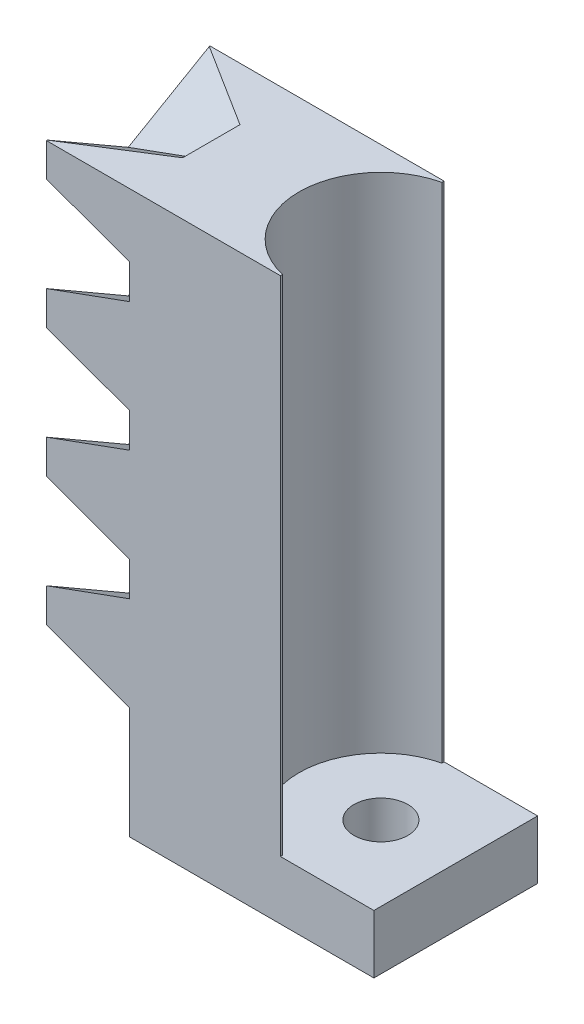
ISO-10303-21;
HEADER;
FILE_DESCRIPTION(('STEP AP214'),'2;1');
FILE_NAME('part.step','',(''),(''),'','','');
FILE_SCHEMA(('AUTOMOTIVE_DESIGN { 1 0 10303 214 1 1 1 1 }'));
ENDSEC;
DATA;
#1=APPLICATION_CONTEXT('core data for automotive mechanical design processes');
#2=APPLICATION_PROTOCOL_DEFINITION('international standard','automotive_design',2000,#1);
#3=PRODUCT_CONTEXT('',#1,'mechanical');
#4=PRODUCT('Part','Part','',(#3));
#5=PRODUCT_RELATED_PRODUCT_CATEGORY('part','',(#4));
#6=PRODUCT_DEFINITION_FORMATION('','',#4);
#7=PRODUCT_DEFINITION_CONTEXT('part definition',#1,'design');
#8=PRODUCT_DEFINITION('design','',#6,#7);
#9=PRODUCT_DEFINITION_SHAPE('','',#8);
#10=(LENGTH_UNIT() NAMED_UNIT(*) SI_UNIT(.MILLI.,.METRE.));
#11=(NAMED_UNIT(*) PLANE_ANGLE_UNIT() SI_UNIT($,.RADIAN.));
#12=(NAMED_UNIT(*) SI_UNIT($,.STERADIAN.) SOLID_ANGLE_UNIT());
#13=UNCERTAINTY_MEASURE_WITH_UNIT(LENGTH_MEASURE(1.E-05),#10,'distance_accuracy_value','');
#14=(GEOMETRIC_REPRESENTATION_CONTEXT(3) GLOBAL_UNCERTAINTY_ASSIGNED_CONTEXT((#13)) GLOBAL_UNIT_ASSIGNED_CONTEXT((#10,
#11,#12)) REPRESENTATION_CONTEXT('',''));
#15=CARTESIAN_POINT('',(0.,0.,0.));
#16=DIRECTION('',(0.,0.,1.));
#17=DIRECTION('',(1.,0.,0.));
#18=AXIS2_PLACEMENT_3D('',#15,#16,#17);
#19=CARTESIAN_POINT('',(8.2,16.4726196,3.5));
#20=DIRECTION('',(-1.,0.,0.));
#21=DIRECTION('',(0.,-1.,0.));
#22=AXIS2_PLACEMENT_3D('',#19,#20,#21);
#23=PLANE('',#22);
#24=DIRECTION('',(0.,-1.,0.));
#25=VECTOR('',#24,1.);
#26=CARTESIAN_POINT('',(8.2,16.4726446,-3.40734500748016));
#27=LINE('',#26,#25);
#28=CARTESIAN_POINT('',(8.2,-5.0273804,-3.40734500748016));
#29=VERTEX_POINT('',#28);
#30=CARTESIAN_POINT('',(8.2,16.4726196,-3.40734500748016));
#31=VERTEX_POINT('',#30);
#32=EDGE_CURVE('E355',#29,#31,#27,.F.);
#33=ORIENTED_EDGE('',*,*,#32,.F.);
#34=DIRECTION('',(0.,0.,1.));
#35=VECTOR('',#34,1.);
#36=CARTESIAN_POINT('',(8.2,-5.0273804,-3.5));
#37=LINE('',#36,#35);
#38=CARTESIAN_POINT('',(8.2,-5.0273804,-3.5));
#39=VERTEX_POINT('',#38);
#40=EDGE_CURVE('E363',#39,#29,#37,.T.);
#41=ORIENTED_EDGE('',*,*,#40,.F.);
#42=DIRECTION('',(0.,1.,0.));
#43=VECTOR('',#42,1.);
#44=CARTESIAN_POINT('',(8.2,16.4726196,-3.5));
#45=LINE('',#44,#43);
#46=CARTESIAN_POINT('',(8.2,16.4726196,-3.5));
#47=VERTEX_POINT('',#46);
#48=EDGE_CURVE('E966',#39,#47,#45,.T.);
#49=ORIENTED_EDGE('',*,*,#48,.T.);
#50=DIRECTION('',(0.,0.,-1.));
#51=VECTOR('',#50,1.);
#52=CARTESIAN_POINT('',(8.2,16.4726196,3.5));
#53=LINE('',#52,#51);
#54=EDGE_CURVE('E981',#31,#47,#53,.T.);
#55=ORIENTED_EDGE('',*,*,#54,.F.);
#56=EDGE_LOOP('',(#33,#41,#49,#55));
#57=FACE_BOUND('',#56,.T.);
#58=ADVANCED_FACE('F125',(#57),#23,.F.);
#59=DIRECTION('',(0.,-1.,0.));
#60=VECTOR('',#59,1.);
#61=CARTESIAN_POINT('',(8.2,16.4726446,3.40734500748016));
#62=LINE('',#61,#60);
#63=CARTESIAN_POINT('',(8.2,16.4726196,3.40734500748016));
#64=VERTEX_POINT('',#63);
#65=CARTESIAN_POINT('',(8.2,-5.0273804,3.40734500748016));
#66=VERTEX_POINT('',#65);
#67=EDGE_CURVE('E343',#64,#66,#62,.T.);
#68=ORIENTED_EDGE('',*,*,#67,.F.);
#69=CARTESIAN_POINT('',(8.2,16.4726196,3.5));
#70=VERTEX_POINT('',#69);
#71=EDGE_CURVE('E1114',#70,#64,#53,.T.);
#72=ORIENTED_EDGE('',*,*,#71,.F.);
#73=DIRECTION('',(0.,1.,0.));
#74=VECTOR('',#73,1.);
#75=CARTESIAN_POINT('',(8.2,16.4726196,3.5));
#76=LINE('',#75,#74);
#77=CARTESIAN_POINT('',(8.2,-5.0273804,3.5));
#78=VERTEX_POINT('',#77);
#79=EDGE_CURVE('E367',#78,#70,#76,.T.);
#80=ORIENTED_EDGE('',*,*,#79,.F.);
#81=EDGE_CURVE('E361',#66,#78,#37,.T.);
#82=ORIENTED_EDGE('',*,*,#81,.F.);
#83=EDGE_LOOP('',(#68,#72,#80,#82));
#84=FACE_BOUND('',#83,.T.);
#85=ADVANCED_FACE('F366',(#84),#23,.F.);
#86=CARTESIAN_POINT('',(-1.8,-7.5273804,3.5));
#87=DIRECTION('',(1.,0.,0.));
#88=DIRECTION('',(0.,1.,0.));
#89=AXIS2_PLACEMENT_3D('',#86,#87,#88);
#90=PLANE('',#89);
#91=DIRECTION('',(0.,0.500000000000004,0.866025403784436));
#92=VECTOR('',#91,1.);
#93=CARTESIAN_POINT('',(-1.8,14.4726196,0.));
#94=LINE('',#93,#92);
#95=CARTESIAN_POINT('',(-1.8,14.4726196,0.));
#96=VERTEX_POINT('',#95);
#97=CARTESIAN_POINT('',(-1.8,16.4726196,3.46410161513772));
#98=VERTEX_POINT('',#97);
#99=EDGE_CURVE('E399',#96,#98,#94,.T.);
#100=ORIENTED_EDGE('',*,*,#99,.F.);
#101=DIRECTION('',(0.,0.500000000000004,-0.866025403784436));
#102=VECTOR('',#101,1.);
#103=CARTESIAN_POINT('',(-1.8,14.4726196,0.));
#104=LINE('',#103,#102);
#105=CARTESIAN_POINT('',(-1.8,16.4726196,-3.46410161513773));
#106=VERTEX_POINT('',#105);
#107=EDGE_CURVE('E1287',#96,#106,#104,.T.);
#108=ORIENTED_EDGE('',*,*,#107,.T.);
#109=DIRECTION('',(0.,0.,-1.));
#110=VECTOR('',#109,1.);
#111=CARTESIAN_POINT('',(-1.8,16.4726196,3.5));
#112=LINE('',#111,#110);
#113=CARTESIAN_POINT('',(-1.8,16.4726196,-3.5));
#114=VERTEX_POINT('',#113);
#115=EDGE_CURVE('E980',#106,#114,#112,.T.);
#116=ORIENTED_EDGE('',*,*,#115,.T.);
#117=DIRECTION('',(0.,-1.,0.));
#118=VECTOR('',#117,1.);
#119=CARTESIAN_POINT('',(-1.8,-7.5273804,-3.5));
#120=LINE('',#119,#118);
#121=CARTESIAN_POINT('',(-1.8,15.0525320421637,-3.5));
#122=VERTEX_POINT('',#121);
#123=EDGE_CURVE('E660',#114,#122,#120,.T.);
#124=ORIENTED_EDGE('',*,*,#123,.T.);
#125=DIRECTION('',(0.,0.500000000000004,-0.866025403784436));
#126=VECTOR('',#125,1.);
#127=CARTESIAN_POINT('',(-1.8,13.0318061,0.));
#128=LINE('',#127,#126);
#129=CARTESIAN_POINT('',(-1.8,13.0318061,0.));
#130=VERTEX_POINT('',#129);
#131=EDGE_CURVE('E1101',#130,#122,#128,.T.);
#132=ORIENTED_EDGE('',*,*,#131,.F.);
#133=DIRECTION('',(0.,0.500000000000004,0.866025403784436));
#134=VECTOR('',#133,1.);
#135=CARTESIAN_POINT('',(-1.8,13.0318061,0.));
#136=LINE('',#135,#134);
#137=CARTESIAN_POINT('',(-1.8,15.0525320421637,3.5));
#138=VERTEX_POINT('',#137);
#139=EDGE_CURVE('E1271',#130,#138,#136,.T.);
#140=ORIENTED_EDGE('',*,*,#139,.T.);
#141=DIRECTION('',(0.,-1.,0.));
#142=VECTOR('',#141,1.);
#143=CARTESIAN_POINT('',(-1.8,-7.5273804,3.5));
#144=LINE('',#143,#142);
#145=CARTESIAN_POINT('',(-1.8,16.4726196,3.5));
#146=VERTEX_POINT('',#145);
#147=EDGE_CURVE('E562',#146,#138,#144,.T.);
#148=ORIENTED_EDGE('',*,*,#147,.F.);
#149=EDGE_CURVE('E1106',#146,#98,#112,.T.);
#150=ORIENTED_EDGE('',*,*,#149,.T.);
#151=EDGE_LOOP('',(#100,#108,#116,#124,#132,#140,#148,#150));
#152=FACE_BOUND('',#151,.T.);
#153=ADVANCED_FACE('F1270',(#152),#90,.F.);
#154=CARTESIAN_POINT('',(-1.8,16.4726196,3.5));
#155=DIRECTION('',(0.,-1.,0.));
#156=DIRECTION('',(0.,0.,-1.));
#157=AXIS2_PLACEMENT_3D('',#154,#155,#156);
#158=PLANE('',#157);
#159=CARTESIAN_POINT('',(9.,16.4726196,0.));
#160=DIRECTION('',(0.,-1.,0.));
#161=DIRECTION('',(0.,0.,-1.));
#162=AXIS2_PLACEMENT_3D('',#159,#160,#161);
#163=CIRCLE('',#162,3.5);
#164=EDGE_CURVE('E349',#31,#64,#163,.F.);
#165=ORIENTED_EDGE('',*,*,#164,.F.);
#166=ORIENTED_EDGE('',*,*,#54,.T.);
#167=DIRECTION('',(-1.,0.,0.));
#168=VECTOR('',#167,1.);
#169=CARTESIAN_POINT('',(-1.8,16.4726196,-3.5));
#170=LINE('',#169,#168);
#171=EDGE_CURVE('E666',#47,#114,#170,.T.);
#172=ORIENTED_EDGE('',*,*,#171,.T.);
#173=ORIENTED_EDGE('',*,*,#115,.F.);
#174=DIRECTION('',(0.845933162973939,0.,0.533288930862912));
#175=VECTOR('',#174,1.);
#176=CARTESIAN_POINT('',(1.34169282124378,16.4726196,-1.48353142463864));
#177=LINE('',#176,#175);
#178=CARTESIAN_POINT('',(1.75,16.4726196,-1.22612846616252));
#179=VERTEX_POINT('',#178);
#180=EDGE_CURVE('E1112',#106,#179,#177,.T.);
#181=ORIENTED_EDGE('',*,*,#180,.T.);
#182=DIRECTION('',(0.,0.,1.));
#183=VECTOR('',#182,1.);
#184=CARTESIAN_POINT('',(1.75,16.4726196,3.5));
#185=LINE('',#184,#183);
#186=CARTESIAN_POINT('',(1.75,16.4726196,1.22612846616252));
#187=VERTEX_POINT('',#186);
#188=EDGE_CURVE('E136',#179,#187,#185,.T.);
#189=ORIENTED_EDGE('',*,*,#188,.T.);
#190=DIRECTION('',(0.845933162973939,0.,-0.533288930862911));
#191=VECTOR('',#190,1.);
#192=CARTESIAN_POINT('',(-1.81619472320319,16.4726196,3.474311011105));
#193=LINE('',#192,#191);
#194=EDGE_CURVE('E402',#98,#187,#193,.T.);
#195=ORIENTED_EDGE('',*,*,#194,.F.);
#196=ORIENTED_EDGE('',*,*,#149,.F.);
#197=DIRECTION('',(-1.,0.,0.));
#198=VECTOR('',#197,1.);
#199=CARTESIAN_POINT('',(-1.8,16.4726196,3.5));
#200=LINE('',#199,#198);
#201=EDGE_CURVE('E829',#70,#146,#200,.T.);
#202=ORIENTED_EDGE('',*,*,#201,.F.);
#203=ORIENTED_EDGE('',*,*,#71,.T.);
#204=EDGE_LOOP('',(#165,#166,#172,#173,#181,#189,#195,#196,#202,#203));
#205=FACE_BOUND('',#204,.T.);
#206=ADVANCED_FACE('F978',(#205),#158,.F.);
#207=DIRECTION('',(0.,0.500000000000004,0.866025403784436));
#208=VECTOR('',#207,1.);
#209=CARTESIAN_POINT('',(-1.8,8.9726196,0.));
#210=LINE('',#209,#208);
#211=CARTESIAN_POINT('',(-1.8,8.9726196,0.));
#212=VERTEX_POINT('',#211);
#213=CARTESIAN_POINT('',(-1.8,10.9933455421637,3.5));
#214=VERTEX_POINT('',#213);
#215=EDGE_CURVE('E545',#212,#214,#210,.T.);
#216=ORIENTED_EDGE('',*,*,#215,.F.);
#217=DIRECTION('',(0.,0.500000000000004,-0.866025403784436));
#218=VECTOR('',#217,1.);
#219=CARTESIAN_POINT('',(-1.8,8.9726196,0.));
#220=LINE('',#219,#218);
#221=CARTESIAN_POINT('',(-1.8,10.9933455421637,-3.5));
#222=VERTEX_POINT('',#221);
#223=EDGE_CURVE('E1288',#212,#222,#220,.T.);
#224=ORIENTED_EDGE('',*,*,#223,.T.);
#225=CARTESIAN_POINT('',(-1.8,9.55253204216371,-3.5));
#226=VERTEX_POINT('',#225);
#227=EDGE_CURVE('E656',#222,#226,#120,.T.);
#228=ORIENTED_EDGE('',*,*,#227,.T.);
#229=DIRECTION('',(0.,0.500000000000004,-0.866025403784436));
#230=VECTOR('',#229,1.);
#231=CARTESIAN_POINT('',(-1.8,7.5318061,0.));
#232=LINE('',#231,#230);
#233=CARTESIAN_POINT('',(-1.8,7.5318061,0.));
#234=VERTEX_POINT('',#233);
#235=EDGE_CURVE('E1018',#234,#226,#232,.T.);
#236=ORIENTED_EDGE('',*,*,#235,.F.);
#237=DIRECTION('',(0.,0.500000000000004,0.866025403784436));
#238=VECTOR('',#237,1.);
#239=CARTESIAN_POINT('',(-1.8,7.5318061,0.));
#240=LINE('',#239,#238);
#241=CARTESIAN_POINT('',(-1.8,9.55253204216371,3.5));
#242=VERTEX_POINT('',#241);
#243=EDGE_CURVE('E1160',#234,#242,#240,.T.);
#244=ORIENTED_EDGE('',*,*,#243,.T.);
#245=EDGE_CURVE('E568',#214,#242,#144,.T.);
#246=ORIENTED_EDGE('',*,*,#245,.F.);
#247=EDGE_LOOP('',(#216,#224,#228,#236,#244,#246));
#248=FACE_BOUND('',#247,.T.);
#249=ADVANCED_FACE('F585',(#248),#90,.F.);
#250=CARTESIAN_POINT('',(0.,0.,3.5));
#251=DIRECTION('',(0.,0.,-1.));
#252=DIRECTION('',(-1.,0.,0.));
#253=AXIS2_PLACEMENT_3D('',#250,#251,#252);
#254=PLANE('',#253);
#255=DIRECTION('',(0.,1.,0.));
#256=VECTOR('',#255,1.);
#257=CARTESIAN_POINT('',(1.75,-4.21456005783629,3.5));
#258=LINE('',#257,#256);
#259=CARTESIAN_POINT('',(1.75,-7.5273804,3.5));
#260=VERTEX_POINT('',#259);
#261=CARTESIAN_POINT('',(1.75,-2.73956235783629,3.5));
#262=VERTEX_POINT('',#261);
#263=EDGE_CURVE('E787',#260,#262,#258,.T.);
#264=ORIENTED_EDGE('',*,*,#263,.F.);
#265=DIRECTION('',(1.,0.,0.));
#266=VECTOR('',#265,1.);
#267=CARTESIAN_POINT('',(8.2,-7.5273804,3.5));
#268=LINE('',#267,#266);
#269=CARTESIAN_POINT('',(12.2,-7.5273804,3.5));
#270=VERTEX_POINT('',#269);
#271=EDGE_CURVE('E824',#260,#270,#268,.T.);
#272=ORIENTED_EDGE('',*,*,#271,.T.);
#273=DIRECTION('',(0.,-1.,0.));
#274=VECTOR('',#273,1.);
#275=CARTESIAN_POINT('',(12.2,-7.5273804,3.5));
#276=LINE('',#275,#274);
#277=CARTESIAN_POINT('',(12.2,-5.0273804,3.5));
#278=VERTEX_POINT('',#277);
#279=EDGE_CURVE('E1129',#278,#270,#276,.T.);
#280=ORIENTED_EDGE('',*,*,#279,.F.);
#281=DIRECTION('',(-1.,0.,0.));
#282=VECTOR('',#281,1.);
#283=CARTESIAN_POINT('',(12.2,-5.0273804,3.5));
#284=LINE('',#283,#282);
#285=EDGE_CURVE('E381',#278,#78,#284,.T.);
#286=ORIENTED_EDGE('',*,*,#285,.T.);
#287=ORIENTED_EDGE('',*,*,#79,.T.);
#288=ORIENTED_EDGE('',*,*,#201,.T.);
#289=ORIENTED_EDGE('',*,*,#147,.T.);
#290=DIRECTION('',(-0.939692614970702,0.342020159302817,0.));
#291=VECTOR('',#290,1.);
#292=CARTESIAN_POINT('',(1.75,13.7604376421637,3.5));
#293=LINE('',#292,#291);
#294=CARTESIAN_POINT('',(1.75,13.7604376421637,3.5));
#295=VERTEX_POINT('',#294);
#296=EDGE_CURVE('E459',#295,#138,#293,.T.);
#297=ORIENTED_EDGE('',*,*,#296,.F.);
#298=DIRECTION('',(0.,1.,0.));
#299=VECTOR('',#298,1.);
#300=CARTESIAN_POINT('',(1.75,12.2854399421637,3.5));
#301=LINE('',#300,#299);
#302=CARTESIAN_POINT('',(1.75,12.2854399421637,3.5));
#303=VERTEX_POINT('',#302);
#304=EDGE_CURVE('E464',#303,#295,#301,.T.);
#305=ORIENTED_EDGE('',*,*,#304,.F.);
#306=DIRECTION('',(0.939692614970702,0.342020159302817,0.));
#307=VECTOR('',#306,1.);
#308=CARTESIAN_POINT('',(-1.8,10.9933455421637,3.5));
#309=LINE('',#308,#307);
#310=EDGE_CURVE('E543',#214,#303,#309,.T.);
#311=ORIENTED_EDGE('',*,*,#310,.F.);
#312=ORIENTED_EDGE('',*,*,#245,.T.);
#313=DIRECTION('',(-0.939692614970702,0.342020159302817,0.));
#314=VECTOR('',#313,1.);
#315=CARTESIAN_POINT('',(1.75,8.26043764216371,3.5));
#316=LINE('',#315,#314);
#317=CARTESIAN_POINT('',(1.75,8.26043764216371,3.5));
#318=VERTEX_POINT('',#317);
#319=EDGE_CURVE('E1154',#318,#242,#316,.T.);
#320=ORIENTED_EDGE('',*,*,#319,.F.);
#321=DIRECTION('',(0.,1.,0.));
#322=VECTOR('',#321,1.);
#323=CARTESIAN_POINT('',(1.75,6.78543994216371,3.5));
#324=LINE('',#323,#322);
#325=CARTESIAN_POINT('',(1.75,6.78543994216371,3.5));
#326=VERTEX_POINT('',#325);
#327=EDGE_CURVE('E1163',#326,#318,#324,.T.);
#328=ORIENTED_EDGE('',*,*,#327,.F.);
#329=DIRECTION('',(0.939692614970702,0.342020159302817,0.));
#330=VECTOR('',#329,1.);
#331=CARTESIAN_POINT('',(-1.8,5.49334554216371,3.5));
#332=LINE('',#331,#330);
#333=CARTESIAN_POINT('',(-1.8,5.49334554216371,3.5));
#334=VERTEX_POINT('',#333);
#335=EDGE_CURVE('E1172',#334,#326,#332,.T.);
#336=ORIENTED_EDGE('',*,*,#335,.F.);
#337=CARTESIAN_POINT('',(-1.8,4.05253204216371,3.5));
#338=VERTEX_POINT('',#337);
#339=EDGE_CURVE('E840',#334,#338,#144,.T.);
#340=ORIENTED_EDGE('',*,*,#339,.T.);
#341=DIRECTION('',(-0.939692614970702,0.342020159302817,0.));
#342=VECTOR('',#341,1.);
#343=CARTESIAN_POINT('',(1.75,2.76043764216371,3.5));
#344=LINE('',#343,#342);
#345=CARTESIAN_POINT('',(1.75,2.76043764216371,3.5));
#346=VERTEX_POINT('',#345);
#347=EDGE_CURVE('E471',#346,#338,#344,.T.);
#348=ORIENTED_EDGE('',*,*,#347,.F.);
#349=DIRECTION('',(0.,1.,0.));
#350=VECTOR('',#349,1.);
#351=CARTESIAN_POINT('',(1.75,1.28543994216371,3.5));
#352=LINE('',#351,#350);
#353=CARTESIAN_POINT('',(1.75,1.28543994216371,3.5));
#354=VERTEX_POINT('',#353);
#355=EDGE_CURVE('E848',#354,#346,#352,.T.);
#356=ORIENTED_EDGE('',*,*,#355,.F.);
#357=DIRECTION('',(0.939692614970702,0.342020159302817,0.));
#358=VECTOR('',#357,1.);
#359=CARTESIAN_POINT('',(-1.8,-0.00665445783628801,3.5));
#360=LINE('',#359,#358);
#361=CARTESIAN_POINT('',(-1.8,-0.00665445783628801,3.5));
#362=VERTEX_POINT('',#361);
#363=EDGE_CURVE('E856',#362,#354,#360,.T.);
#364=ORIENTED_EDGE('',*,*,#363,.F.);
#365=CARTESIAN_POINT('',(-1.8,-1.44746795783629,3.5));
#366=VERTEX_POINT('',#365);
#367=EDGE_CURVE('E799',#362,#366,#144,.T.);
#368=ORIENTED_EDGE('',*,*,#367,.T.);
#369=DIRECTION('',(-0.939692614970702,0.342020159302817,0.));
#370=VECTOR('',#369,1.);
#371=CARTESIAN_POINT('',(1.75,-2.73956235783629,3.5));
#372=LINE('',#371,#370);
#373=EDGE_CURVE('E681',#262,#366,#372,.T.);
#374=ORIENTED_EDGE('',*,*,#373,.F.);
#375=EDGE_LOOP('',(#264,#272,#280,#286,#287,#288,#289,#297,#305,#311,#312,#320,#328,#336,#340,
#348,#356,#364,#368,#374));
#376=FACE_BOUND('',#375,.T.);
#377=ADVANCED_FACE('F560',(#376),#254,.F.);
#378=DIRECTION('',(0.,0.500000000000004,0.866025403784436));
#379=VECTOR('',#378,1.);
#380=CARTESIAN_POINT('',(-1.8,3.4726196,0.));
#381=LINE('',#380,#379);
#382=CARTESIAN_POINT('',(-1.8,3.4726196,0.));
#383=VERTEX_POINT('',#382);
#384=EDGE_CURVE('E1167',#383,#334,#381,.T.);
#385=ORIENTED_EDGE('',*,*,#384,.F.);
#386=DIRECTION('',(0.,0.500000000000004,-0.866025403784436));
#387=VECTOR('',#386,1.);
#388=CARTESIAN_POINT('',(-1.8,3.4726196,0.));
#389=LINE('',#388,#387);
#390=CARTESIAN_POINT('',(-1.8,5.49334554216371,-3.5));
#391=VERTEX_POINT('',#390);
#392=EDGE_CURVE('E1021',#383,#391,#389,.T.);
#393=ORIENTED_EDGE('',*,*,#392,.T.);
#394=CARTESIAN_POINT('',(-1.8,4.05253204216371,-3.5));
#395=VERTEX_POINT('',#394);
#396=EDGE_CURVE('E661',#391,#395,#120,.T.);
#397=ORIENTED_EDGE('',*,*,#396,.T.);
#398=DIRECTION('',(0.,0.500000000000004,-0.866025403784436));
#399=VECTOR('',#398,1.);
#400=CARTESIAN_POINT('',(-1.8,2.0318061,0.));
#401=LINE('',#400,#399);
#402=CARTESIAN_POINT('',(-1.8,2.0318061,0.));
#403=VERTEX_POINT('',#402);
#404=EDGE_CURVE('E718',#403,#395,#401,.T.);
#405=ORIENTED_EDGE('',*,*,#404,.F.);
#406=DIRECTION('',(0.,0.500000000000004,0.866025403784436));
#407=VECTOR('',#406,1.);
#408=CARTESIAN_POINT('',(-1.8,2.0318061,0.));
#409=LINE('',#408,#407);
#410=EDGE_CURVE('E1220',#403,#338,#409,.T.);
#411=ORIENTED_EDGE('',*,*,#410,.T.);
#412=ORIENTED_EDGE('',*,*,#339,.F.);
#413=EDGE_LOOP('',(#385,#393,#397,#405,#411,#412));
#414=FACE_BOUND('',#413,.T.);
#415=ADVANCED_FACE('F584',(#414),#90,.F.);
#416=DIRECTION('',(0.,0.500000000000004,0.866025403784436));
#417=VECTOR('',#416,1.);
#418=CARTESIAN_POINT('',(-1.8,-2.0273804,0.));
#419=LINE('',#418,#417);
#420=CARTESIAN_POINT('',(-1.8,-2.0273804,0.));
#421=VERTEX_POINT('',#420);
#422=EDGE_CURVE('E875',#421,#362,#419,.T.);
#423=ORIENTED_EDGE('',*,*,#422,.F.);
#424=DIRECTION('',(0.,0.500000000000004,-0.866025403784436));
#425=VECTOR('',#424,1.);
#426=CARTESIAN_POINT('',(-1.8,-2.0273804,0.));
#427=LINE('',#426,#425);
#428=CARTESIAN_POINT('',(-1.8,-0.00665445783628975,-3.5));
#429=VERTEX_POINT('',#428);
#430=EDGE_CURVE('E924',#421,#429,#427,.T.);
#431=ORIENTED_EDGE('',*,*,#430,.T.);
#432=CARTESIAN_POINT('',(-1.8,-1.44746795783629,-3.5));
#433=VERTEX_POINT('',#432);
#434=EDGE_CURVE('E677',#429,#433,#120,.T.);
#435=ORIENTED_EDGE('',*,*,#434,.T.);
#436=DIRECTION('',(0.,0.500000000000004,-0.866025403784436));
#437=VECTOR('',#436,1.);
#438=CARTESIAN_POINT('',(-1.8,-3.4681939,0.));
#439=LINE('',#438,#437);
#440=CARTESIAN_POINT('',(-1.8,-3.4681939,0.));
#441=VERTEX_POINT('',#440);
#442=EDGE_CURVE('E768',#441,#433,#439,.T.);
#443=ORIENTED_EDGE('',*,*,#442,.F.);
#444=DIRECTION('',(0.,0.500000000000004,0.866025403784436));
#445=VECTOR('',#444,1.);
#446=CARTESIAN_POINT('',(-1.8,-3.4681939,0.));
#447=LINE('',#446,#445);
#448=EDGE_CURVE('E777',#441,#366,#447,.T.);
#449=ORIENTED_EDGE('',*,*,#448,.T.);
#450=ORIENTED_EDGE('',*,*,#367,.F.);
#451=EDGE_LOOP('',(#423,#431,#435,#443,#449,#450));
#452=FACE_BOUND('',#451,.T.);
#453=ADVANCED_FACE('F798',(#452),#90,.F.);
#454=CARTESIAN_POINT('',(8.2,-7.5273804,3.5));
#455=DIRECTION('',(0.,1.,0.));
#456=DIRECTION('',(-1.,0.,0.));
#457=AXIS2_PLACEMENT_3D('',#454,#455,#456);
#458=PLANE('',#457);
#459=CARTESIAN_POINT('',(9.,-7.5273804,0.));
#460=DIRECTION('',(0.,1.,0.));
#461=DIRECTION('',(-1.,0.,0.));
#462=AXIS2_PLACEMENT_3D('',#459,#460,#461);
#463=CIRCLE('',#462,1.15);
#464=CARTESIAN_POINT('',(7.85,-7.5273804,0.));
#465=VERTEX_POINT('',#464);
#466=EDGE_CURVE('E369',#465,#465,#463,.T.);
#467=ORIENTED_EDGE('',*,*,#466,.T.);
#468=EDGE_LOOP('',(#467));
#469=FACE_BOUND('',#468,.T.);
#470=ORIENTED_EDGE('',*,*,#271,.F.);
#471=DIRECTION('',(0.,0.,1.));
#472=VECTOR('',#471,1.);
#473=CARTESIAN_POINT('',(1.75,-7.5273804,-8.35564399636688));
#474=LINE('',#473,#472);
#475=CARTESIAN_POINT('',(1.75,-7.5273804,-3.5));
#476=VERTEX_POINT('',#475);
#477=EDGE_CURVE('E386',#476,#260,#474,.T.);
#478=ORIENTED_EDGE('',*,*,#477,.F.);
#479=DIRECTION('',(1.,0.,0.));
#480=VECTOR('',#479,1.);
#481=CARTESIAN_POINT('',(8.2,-7.5273804,-3.5));
#482=LINE('',#481,#480);
#483=CARTESIAN_POINT('',(12.2,-7.5273804,-3.5));
#484=VERTEX_POINT('',#483);
#485=EDGE_CURVE('E811',#476,#484,#482,.T.);
#486=ORIENTED_EDGE('',*,*,#485,.T.);
#487=DIRECTION('',(0.,0.,-1.));
#488=VECTOR('',#487,1.);
#489=CARTESIAN_POINT('',(12.2,-7.5273804,-3.5));
#490=LINE('',#489,#488);
#491=EDGE_CURVE('E379',#270,#484,#490,.T.);
#492=ORIENTED_EDGE('',*,*,#491,.F.);
#493=EDGE_LOOP('',(#470,#478,#486,#492));
#494=FACE_BOUND('',#493,.T.);
#495=ADVANCED_FACE('F127',(#469,#494),#458,.F.);
#496=CARTESIAN_POINT('',(0.,0.,-3.5));
#497=DIRECTION('',(0.,0.,-1.));
#498=DIRECTION('',(-1.,0.,0.));
#499=AXIS2_PLACEMENT_3D('',#496,#497,#498);
#500=PLANE('',#499);
#501=ORIENTED_EDGE('',*,*,#485,.F.);
#502=DIRECTION('',(0.,1.,0.));
#503=VECTOR('',#502,1.);
#504=CARTESIAN_POINT('',(1.75,-4.21456005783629,-3.5));
#505=LINE('',#504,#503);
#506=CARTESIAN_POINT('',(1.75,-2.73956235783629,-3.5));
#507=VERTEX_POINT('',#506);
#508=EDGE_CURVE('E804',#476,#507,#505,.T.);
#509=ORIENTED_EDGE('',*,*,#508,.T.);
#510=DIRECTION('',(-0.939692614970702,0.342020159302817,0.));
#511=VECTOR('',#510,1.);
#512=CARTESIAN_POINT('',(1.75,-2.73956235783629,-3.5));
#513=LINE('',#512,#511);
#514=EDGE_CURVE('E807',#507,#433,#513,.T.);
#515=ORIENTED_EDGE('',*,*,#514,.T.);
#516=ORIENTED_EDGE('',*,*,#434,.F.);
#517=DIRECTION('',(0.939692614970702,0.342020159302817,0.));
#518=VECTOR('',#517,1.);
#519=CARTESIAN_POINT('',(-1.8,-0.00665445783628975,-3.5));
#520=LINE('',#519,#518);
#521=CARTESIAN_POINT('',(1.75,1.28543994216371,-3.5));
#522=VERTEX_POINT('',#521);
#523=EDGE_CURVE('E689',#429,#522,#520,.T.);
#524=ORIENTED_EDGE('',*,*,#523,.T.);
#525=DIRECTION('',(0.,1.,0.));
#526=VECTOR('',#525,1.);
#527=CARTESIAN_POINT('',(1.75,1.28543994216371,-3.5));
#528=LINE('',#527,#526);
#529=CARTESIAN_POINT('',(1.75,2.76043764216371,-3.5));
#530=VERTEX_POINT('',#529);
#531=EDGE_CURVE('E705',#522,#530,#528,.T.);
#532=ORIENTED_EDGE('',*,*,#531,.T.);
#533=DIRECTION('',(-0.939692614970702,0.342020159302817,0.));
#534=VECTOR('',#533,1.);
#535=CARTESIAN_POINT('',(1.75,2.76043764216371,-3.5));
#536=LINE('',#535,#534);
#537=EDGE_CURVE('E701',#530,#395,#536,.T.);
#538=ORIENTED_EDGE('',*,*,#537,.T.);
#539=ORIENTED_EDGE('',*,*,#396,.F.);
#540=DIRECTION('',(0.939692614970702,0.342020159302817,0.));
#541=VECTOR('',#540,1.);
#542=CARTESIAN_POINT('',(-1.8,5.49334554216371,-3.5));
#543=LINE('',#542,#541);
#544=CARTESIAN_POINT('',(1.75,6.78543994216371,-3.5));
#545=VERTEX_POINT('',#544);
#546=EDGE_CURVE('E654',#391,#545,#543,.T.);
#547=ORIENTED_EDGE('',*,*,#546,.T.);
#548=DIRECTION('',(0.,1.,0.));
#549=VECTOR('',#548,1.);
#550=CARTESIAN_POINT('',(1.75,6.78543994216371,-3.5));
#551=LINE('',#550,#549);
#552=CARTESIAN_POINT('',(1.75,8.26043764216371,-3.5));
#553=VERTEX_POINT('',#552);
#554=EDGE_CURVE('E653',#545,#553,#551,.T.);
#555=ORIENTED_EDGE('',*,*,#554,.T.);
#556=DIRECTION('',(-0.939692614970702,0.342020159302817,0.));
#557=VECTOR('',#556,1.);
#558=CARTESIAN_POINT('',(1.75,8.26043764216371,-3.5));
#559=LINE('',#558,#557);
#560=EDGE_CURVE('E647',#553,#226,#559,.T.);
#561=ORIENTED_EDGE('',*,*,#560,.T.);
#562=ORIENTED_EDGE('',*,*,#227,.F.);
#563=DIRECTION('',(0.939692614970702,0.342020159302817,0.));
#564=VECTOR('',#563,1.);
#565=CARTESIAN_POINT('',(-1.8,10.9933455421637,-3.5));
#566=LINE('',#565,#564);
#567=CARTESIAN_POINT('',(1.75,12.2854399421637,-3.5));
#568=VERTEX_POINT('',#567);
#569=EDGE_CURVE('E522',#222,#568,#566,.T.);
#570=ORIENTED_EDGE('',*,*,#569,.T.);
#571=DIRECTION('',(0.,1.,0.));
#572=VECTOR('',#571,1.);
#573=CARTESIAN_POINT('',(1.75,12.2854399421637,-3.5));
#574=LINE('',#573,#572);
#575=CARTESIAN_POINT('',(1.75,13.7604376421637,-3.5));
#576=VERTEX_POINT('',#575);
#577=EDGE_CURVE('E1100',#568,#576,#574,.T.);
#578=ORIENTED_EDGE('',*,*,#577,.T.);
#579=DIRECTION('',(-0.939692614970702,0.342020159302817,0.));
#580=VECTOR('',#579,1.);
#581=CARTESIAN_POINT('',(1.75,13.7604376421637,-3.5));
#582=LINE('',#581,#580);
#583=EDGE_CURVE('E635',#576,#122,#582,.T.);
#584=ORIENTED_EDGE('',*,*,#583,.T.);
#585=ORIENTED_EDGE('',*,*,#123,.F.);
#586=ORIENTED_EDGE('',*,*,#171,.F.);
#587=ORIENTED_EDGE('',*,*,#48,.F.);
#588=DIRECTION('',(-1.,0.,0.));
#589=VECTOR('',#588,1.);
#590=CARTESIAN_POINT('',(12.2,-5.0273804,-3.5));
#591=LINE('',#590,#589);
#592=CARTESIAN_POINT('',(12.2,-5.0273804,-3.5));
#593=VERTEX_POINT('',#592);
#594=EDGE_CURVE('E144',#593,#39,#591,.T.);
#595=ORIENTED_EDGE('',*,*,#594,.F.);
#596=DIRECTION('',(0.,1.,0.));
#597=VECTOR('',#596,1.);
#598=CARTESIAN_POINT('',(12.2,-7.5273804,-3.5));
#599=LINE('',#598,#597);
#600=EDGE_CURVE('E373',#484,#593,#599,.T.);
#601=ORIENTED_EDGE('',*,*,#600,.F.);
#602=EDGE_LOOP('',(#501,#509,#515,#516,#524,#532,#538,#539,#547,#555,#561,#562,#570,#578,#584,
#585,#586,#587,#595,#601));
#603=FACE_BOUND('',#602,.T.);
#604=ADVANCED_FACE('F589',(#603),#500,.T.);
#605=CARTESIAN_POINT('',(1.75,0.,0.));
#606=DIRECTION('',(1.,0.,0.));
#607=DIRECTION('',(0.,0.,-1.));
#608=AXIS2_PLACEMENT_3D('',#605,#606,#607);
#609=PLANE('',#608);
#610=DIRECTION('',(0.,0.500000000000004,0.866025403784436));
#611=VECTOR('',#610,1.);
#612=CARTESIAN_POINT('',(1.75,-4.7602883,0.));
#613=LINE('',#612,#611);
#614=CARTESIAN_POINT('',(1.75,-4.21456005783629,0.94522904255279));
#615=VERTEX_POINT('',#614);
#616=EDGE_CURVE('E775',#615,#262,#613,.T.);
#617=ORIENTED_EDGE('',*,*,#616,.F.);
#618=DIRECTION('',(0.,0.,1.));
#619=VECTOR('',#618,1.);
#620=CARTESIAN_POINT('',(1.75,-4.21456005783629,-8.35564399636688));
#621=LINE('',#620,#619);
#622=CARTESIAN_POINT('',(1.75,-4.21456005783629,-0.945229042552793));
#623=VERTEX_POINT('',#622);
#624=EDGE_CURVE('E151',#623,#615,#621,.T.);
#625=ORIENTED_EDGE('',*,*,#624,.F.);
#626=DIRECTION('',(0.,0.500000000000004,-0.866025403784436));
#627=VECTOR('',#626,1.);
#628=CARTESIAN_POINT('',(1.75,-4.7602883,0.));
#629=LINE('',#628,#627);
#630=EDGE_CURVE('E770',#623,#507,#629,.T.);
#631=ORIENTED_EDGE('',*,*,#630,.T.);
#632=ORIENTED_EDGE('',*,*,#508,.F.);
#633=ORIENTED_EDGE('',*,*,#477,.T.);
#634=ORIENTED_EDGE('',*,*,#263,.T.);
#635=EDGE_LOOP('',(#617,#625,#631,#632,#633,#634));
#636=FACE_BOUND('',#635,.T.);
#637=ADVANCED_FACE('F744',(#636),#609,.F.);
#638=CARTESIAN_POINT('',(-1.02385412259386,-2.81301593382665,-1.62409550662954));
#639=DIRECTION('',(0.300626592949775,0.825964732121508,0.476870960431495));
#640=DIRECTION('',(0.,-0.500000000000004,0.866025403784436));
#641=AXIS2_PLACEMENT_3D('',#638,#639,#640);
#642=PLANE('',#641);
#643=ORIENTED_EDGE('',*,*,#630,.F.);
#644=DIRECTION('',(-0.606097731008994,-0.220601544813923,0.764186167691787));
#645=VECTOR('',#644,1.);
#646=CARTESIAN_POINT('',(1.2328389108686,-4.4027913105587,-0.293176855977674));
#647=LINE('',#646,#645);
#648=CARTESIAN_POINT('',(1.00031202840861,-4.48742417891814,0.));
#649=VERTEX_POINT('',#648);
#650=EDGE_CURVE('E389',#623,#649,#647,.T.);
#651=ORIENTED_EDGE('',*,*,#650,.T.);
#652=DIRECTION('',(-0.939692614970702,0.342020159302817,0.));
#653=VECTOR('',#652,1.);
#654=CARTESIAN_POINT('',(1.75,-4.7602883,0.));
#655=LINE('',#654,#653);
#656=EDGE_CURVE('E129',#649,#441,#655,.T.);
#657=ORIENTED_EDGE('',*,*,#656,.T.);
#658=ORIENTED_EDGE('',*,*,#442,.T.);
#659=ORIENTED_EDGE('',*,*,#514,.F.);
#660=EDGE_LOOP('',(#643,#651,#657,#658,#659));
#661=FACE_BOUND('',#660,.T.);
#662=ADVANCED_FACE('F586',(#661),#642,.F.);
#663=CARTESIAN_POINT('',(-1.02385412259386,-2.81301593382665,1.62409550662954));
#664=DIRECTION('',(-0.300626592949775,-0.825964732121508,0.476870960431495));
#665=DIRECTION('',(0.,-0.500000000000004,-0.866025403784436));
#666=AXIS2_PLACEMENT_3D('',#663,#664,#665);
#667=PLANE('',#666);
#668=DIRECTION('',(-0.606097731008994,-0.220601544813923,-0.764186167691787));
#669=VECTOR('',#668,1.);
#670=CARTESIAN_POINT('',(1.23283891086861,-4.4027913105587,0.293176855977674));
#671=LINE('',#670,#669);
#672=EDGE_CURVE('E12',#615,#649,#671,.T.);
#673=ORIENTED_EDGE('',*,*,#672,.F.);
#674=ORIENTED_EDGE('',*,*,#616,.T.);
#675=ORIENTED_EDGE('',*,*,#373,.T.);
#676=ORIENTED_EDGE('',*,*,#448,.F.);
#677=ORIENTED_EDGE('',*,*,#656,.F.);
#678=EDGE_LOOP('',(#673,#674,#675,#676,#677));
#679=FACE_BOUND('',#678,.T.);
#680=ADVANCED_FACE('F730',(#679),#667,.T.);
#681=CARTESIAN_POINT('',(1.75,5.5,0.));
#682=DIRECTION('',(1.,0.,0.));
#683=DIRECTION('',(0.,0.,-1.));
#684=AXIS2_PLACEMENT_3D('',#681,#682,#683);
#685=PLANE('',#684);
#686=DIRECTION('',(0.,0.500000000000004,-0.866025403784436));
#687=VECTOR('',#686,1.);
#688=CARTESIAN_POINT('',(1.75,-0.735286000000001,0.));
#689=LINE('',#688,#687);
#690=CARTESIAN_POINT('',(1.75,-0.735286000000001,0.));
#691=VERTEX_POINT('',#690);
#692=EDGE_CURVE('E880',#691,#522,#689,.T.);
#693=ORIENTED_EDGE('',*,*,#692,.F.);
#694=DIRECTION('',(0.,0.500000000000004,0.866025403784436));
#695=VECTOR('',#694,1.);
#696=CARTESIAN_POINT('',(1.75,-0.735286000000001,0.));
#697=LINE('',#696,#695);
#698=EDGE_CURVE('E1222',#691,#354,#697,.T.);
#699=ORIENTED_EDGE('',*,*,#698,.T.);
#700=ORIENTED_EDGE('',*,*,#355,.T.);
#701=DIRECTION('',(0.,0.500000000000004,0.866025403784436));
#702=VECTOR('',#701,1.);
#703=CARTESIAN_POINT('',(1.75,0.7397117,0.));
#704=LINE('',#703,#702);
#705=CARTESIAN_POINT('',(1.75,0.7397117,0.));
#706=VERTEX_POINT('',#705);
#707=EDGE_CURVE('E1162',#706,#346,#704,.T.);
#708=ORIENTED_EDGE('',*,*,#707,.F.);
#709=DIRECTION('',(0.,0.500000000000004,-0.866025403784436));
#710=VECTOR('',#709,1.);
#711=CARTESIAN_POINT('',(1.75,0.7397117,0.));
#712=LINE('',#711,#710);
#713=EDGE_CURVE('E915',#706,#530,#712,.T.);
#714=ORIENTED_EDGE('',*,*,#713,.T.);
#715=ORIENTED_EDGE('',*,*,#531,.F.);
#716=EDGE_LOOP('',(#693,#699,#700,#708,#714,#715));
#717=FACE_BOUND('',#716,.T.);
#718=ADVANCED_FACE('F739',(#717),#685,.F.);
#719=CARTESIAN_POINT('',(-1.02385412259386,2.68698406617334,-1.62409550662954));
#720=DIRECTION('',(0.300626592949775,0.825964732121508,0.476870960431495));
#721=DIRECTION('',(0.,-0.500000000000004,0.866025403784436));
#722=AXIS2_PLACEMENT_3D('',#719,#720,#721);
#723=PLANE('',#722);
#724=ORIENTED_EDGE('',*,*,#713,.F.);
#725=DIRECTION('',(-0.939692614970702,0.342020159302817,0.));
#726=VECTOR('',#725,1.);
#727=CARTESIAN_POINT('',(1.75,0.7397117,0.));
#728=LINE('',#727,#726);
#729=EDGE_CURVE('E876',#706,#403,#728,.T.);
#730=ORIENTED_EDGE('',*,*,#729,.T.);
#731=ORIENTED_EDGE('',*,*,#404,.T.);
#732=ORIENTED_EDGE('',*,*,#537,.F.);
#733=EDGE_LOOP('',(#724,#730,#731,#732));
#734=FACE_BOUND('',#733,.T.);
#735=ADVANCED_FACE('F899',(#734),#723,.F.);
#736=CARTESIAN_POINT('',(1.70642354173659,0.811640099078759,-2.70682585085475));
#737=DIRECTION('',(0.300626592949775,-0.825964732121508,-0.476870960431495));
#738=DIRECTION('',(0.,0.500000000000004,-0.866025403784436));
#739=AXIS2_PLACEMENT_3D('',#736,#737,#738);
#740=PLANE('',#739);
#741=ORIENTED_EDGE('',*,*,#430,.F.);
#742=DIRECTION('',(0.939692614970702,0.342020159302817,0.));
#743=VECTOR('',#742,1.);
#744=CARTESIAN_POINT('',(-1.8,-2.0273804,0.));
#745=LINE('',#744,#743);
#746=EDGE_CURVE('E652',#421,#691,#745,.T.);
#747=ORIENTED_EDGE('',*,*,#746,.T.);
#748=ORIENTED_EDGE('',*,*,#692,.T.);
#749=ORIENTED_EDGE('',*,*,#523,.F.);
#750=EDGE_LOOP('',(#741,#747,#748,#749));
#751=FACE_BOUND('',#750,.T.);
#752=ADVANCED_FACE('F741',(#751),#740,.F.);
#753=CARTESIAN_POINT('',(1.75,11.,0.));
#754=DIRECTION('',(1.,0.,0.));
#755=DIRECTION('',(0.,0.,-1.));
#756=AXIS2_PLACEMENT_3D('',#753,#754,#755);
#757=PLANE('',#756);
#758=DIRECTION('',(0.,0.500000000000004,-0.866025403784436));
#759=VECTOR('',#758,1.);
#760=CARTESIAN_POINT('',(1.75,4.764714,0.));
#761=LINE('',#760,#759);
#762=CARTESIAN_POINT('',(1.75,4.764714,0.));
#763=VERTEX_POINT('',#762);
#764=EDGE_CURVE('E1035',#763,#545,#761,.T.);
#765=ORIENTED_EDGE('',*,*,#764,.F.);
#766=DIRECTION('',(0.,0.500000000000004,0.866025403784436));
#767=VECTOR('',#766,1.);
#768=CARTESIAN_POINT('',(1.75,4.764714,0.));
#769=LINE('',#768,#767);
#770=EDGE_CURVE('E1168',#763,#326,#769,.T.);
#771=ORIENTED_EDGE('',*,*,#770,.T.);
#772=ORIENTED_EDGE('',*,*,#327,.T.);
#773=DIRECTION('',(0.,0.500000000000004,0.866025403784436));
#774=VECTOR('',#773,1.);
#775=CARTESIAN_POINT('',(1.75,6.2397117,0.));
#776=LINE('',#775,#774);
#777=CARTESIAN_POINT('',(1.75,6.2397117,0.));
#778=VERTEX_POINT('',#777);
#779=EDGE_CURVE('E463',#778,#318,#776,.T.);
#780=ORIENTED_EDGE('',*,*,#779,.F.);
#781=DIRECTION('',(0.,0.500000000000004,-0.866025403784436));
#782=VECTOR('',#781,1.);
#783=CARTESIAN_POINT('',(1.75,6.2397117,0.));
#784=LINE('',#783,#782);
#785=EDGE_CURVE('E1027',#778,#553,#784,.T.);
#786=ORIENTED_EDGE('',*,*,#785,.T.);
#787=ORIENTED_EDGE('',*,*,#554,.F.);
#788=EDGE_LOOP('',(#765,#771,#772,#780,#786,#787));
#789=FACE_BOUND('',#788,.T.);
#790=ADVANCED_FACE('F1081',(#789),#757,.F.);
#791=CARTESIAN_POINT('',(-1.02385412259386,8.18698406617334,-1.62409550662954));
#792=DIRECTION('',(0.300626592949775,0.825964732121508,0.476870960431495));
#793=DIRECTION('',(0.,-0.500000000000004,0.866025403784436));
#794=AXIS2_PLACEMENT_3D('',#791,#792,#793);
#795=PLANE('',#794);
#796=ORIENTED_EDGE('',*,*,#785,.F.);
#797=DIRECTION('',(-0.939692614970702,0.342020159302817,0.));
#798=VECTOR('',#797,1.);
#799=CARTESIAN_POINT('',(1.75,6.2397117,0.));
#800=LINE('',#799,#798);
#801=EDGE_CURVE('E634',#778,#234,#800,.T.);
#802=ORIENTED_EDGE('',*,*,#801,.T.);
#803=ORIENTED_EDGE('',*,*,#235,.T.);
#804=ORIENTED_EDGE('',*,*,#560,.F.);
#805=EDGE_LOOP('',(#796,#802,#803,#804));
#806=FACE_BOUND('',#805,.T.);
#807=ADVANCED_FACE('F1055',(#806),#795,.F.);
#808=CARTESIAN_POINT('',(1.70642354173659,6.31164009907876,-2.70682585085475));
#809=DIRECTION('',(0.300626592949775,-0.825964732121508,-0.476870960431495));
#810=DIRECTION('',(0.,0.500000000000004,-0.866025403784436));
#811=AXIS2_PLACEMENT_3D('',#808,#809,#810);
#812=PLANE('',#811);
#813=ORIENTED_EDGE('',*,*,#392,.F.);
#814=DIRECTION('',(0.939692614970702,0.342020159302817,0.));
#815=VECTOR('',#814,1.);
#816=CARTESIAN_POINT('',(-1.8,3.4726196,0.));
#817=LINE('',#816,#815);
#818=EDGE_CURVE('E624',#383,#763,#817,.T.);
#819=ORIENTED_EDGE('',*,*,#818,.T.);
#820=ORIENTED_EDGE('',*,*,#764,.T.);
#821=ORIENTED_EDGE('',*,*,#546,.F.);
#822=EDGE_LOOP('',(#813,#819,#820,#821));
#823=FACE_BOUND('',#822,.T.);
#824=ADVANCED_FACE('F1046',(#823),#812,.F.);
#825=CARTESIAN_POINT('',(1.75,16.5,0.));
#826=DIRECTION('',(1.,0.,0.));
#827=DIRECTION('',(0.,0.,-1.));
#828=AXIS2_PLACEMENT_3D('',#825,#826,#827);
#829=PLANE('',#828);
#830=DIRECTION('',(0.,0.500000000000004,-0.866025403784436));
#831=VECTOR('',#830,1.);
#832=CARTESIAN_POINT('',(1.75,10.264714,0.));
#833=LINE('',#832,#831);
#834=CARTESIAN_POINT('',(1.75,10.264714,0.));
#835=VERTEX_POINT('',#834);
#836=EDGE_CURVE('E540',#835,#568,#833,.T.);
#837=ORIENTED_EDGE('',*,*,#836,.F.);
#838=DIRECTION('',(0.,0.500000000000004,0.866025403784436));
#839=VECTOR('',#838,1.);
#840=CARTESIAN_POINT('',(1.75,10.264714,0.));
#841=LINE('',#840,#839);
#842=EDGE_CURVE('E555',#835,#303,#841,.T.);
#843=ORIENTED_EDGE('',*,*,#842,.T.);
#844=ORIENTED_EDGE('',*,*,#304,.T.);
#845=DIRECTION('',(0.,0.500000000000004,0.866025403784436));
#846=VECTOR('',#845,1.);
#847=CARTESIAN_POINT('',(1.75,11.7397117,0.));
#848=LINE('',#847,#846);
#849=CARTESIAN_POINT('',(1.75,11.7397117,0.));
#850=VERTEX_POINT('',#849);
#851=EDGE_CURVE('E554',#850,#295,#848,.T.);
#852=ORIENTED_EDGE('',*,*,#851,.F.);
#853=DIRECTION('',(0.,0.500000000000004,-0.866025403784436));
#854=VECTOR('',#853,1.);
#855=CARTESIAN_POINT('',(1.75,11.7397117,0.));
#856=LINE('',#855,#854);
#857=EDGE_CURVE('E489',#850,#576,#856,.T.);
#858=ORIENTED_EDGE('',*,*,#857,.T.);
#859=ORIENTED_EDGE('',*,*,#577,.F.);
#860=EDGE_LOOP('',(#837,#843,#844,#852,#858,#859));
#861=FACE_BOUND('',#860,.T.);
#862=ADVANCED_FACE('F502',(#861),#829,.F.);
#863=CARTESIAN_POINT('',(-1.02385412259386,13.6869840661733,-1.62409550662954));
#864=DIRECTION('',(0.300626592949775,0.825964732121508,0.476870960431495));
#865=DIRECTION('',(0.,-0.500000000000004,0.866025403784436));
#866=AXIS2_PLACEMENT_3D('',#863,#864,#865);
#867=PLANE('',#866);
#868=ORIENTED_EDGE('',*,*,#857,.F.);
#869=DIRECTION('',(-0.939692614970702,0.342020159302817,0.));
#870=VECTOR('',#869,1.);
#871=CARTESIAN_POINT('',(1.75,11.7397117,0.));
#872=LINE('',#871,#870);
#873=EDGE_CURVE('E483',#850,#130,#872,.T.);
#874=ORIENTED_EDGE('',*,*,#873,.T.);
#875=ORIENTED_EDGE('',*,*,#131,.T.);
#876=ORIENTED_EDGE('',*,*,#583,.F.);
#877=EDGE_LOOP('',(#868,#874,#875,#876));
#878=FACE_BOUND('',#877,.T.);
#879=ADVANCED_FACE('F491',(#878),#867,.F.);
#880=CARTESIAN_POINT('',(1.70642354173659,11.8116400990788,-2.70682585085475));
#881=DIRECTION('',(0.300626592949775,-0.825964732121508,-0.476870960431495));
#882=DIRECTION('',(0.,0.500000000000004,-0.866025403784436));
#883=AXIS2_PLACEMENT_3D('',#880,#881,#882);
#884=PLANE('',#883);
#885=ORIENTED_EDGE('',*,*,#223,.F.);
#886=DIRECTION('',(0.939692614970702,0.342020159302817,0.));
#887=VECTOR('',#886,1.);
#888=CARTESIAN_POINT('',(-1.8,8.9726196,0.));
#889=LINE('',#888,#887);
#890=EDGE_CURVE('E541',#212,#835,#889,.T.);
#891=ORIENTED_EDGE('',*,*,#890,.T.);
#892=ORIENTED_EDGE('',*,*,#836,.T.);
#893=ORIENTED_EDGE('',*,*,#569,.F.);
#894=EDGE_LOOP('',(#885,#891,#892,#893));
#895=FACE_BOUND('',#894,.T.);
#896=ADVANCED_FACE('F501',(#895),#884,.F.);
#897=CARTESIAN_POINT('',(1.75,22.,0.));
#898=DIRECTION('',(1.,0.,0.));
#899=DIRECTION('',(0.,0.,-1.));
#900=AXIS2_PLACEMENT_3D('',#897,#898,#899);
#901=PLANE('',#900);
#902=DIRECTION('',(0.,0.500000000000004,-0.866025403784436));
#903=VECTOR('',#902,1.);
#904=CARTESIAN_POINT('',(1.75,15.764714,0.));
#905=LINE('',#904,#903);
#906=CARTESIAN_POINT('',(1.75,15.764714,0.));
#907=VERTEX_POINT('',#906);
#908=EDGE_CURVE('E470',#907,#179,#905,.T.);
#909=ORIENTED_EDGE('',*,*,#908,.F.);
#910=DIRECTION('',(0.,0.500000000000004,0.866025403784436));
#911=VECTOR('',#910,1.);
#912=CARTESIAN_POINT('',(1.75,15.764714,0.));
#913=LINE('',#912,#911);
#914=EDGE_CURVE('E396',#907,#187,#913,.T.);
#915=ORIENTED_EDGE('',*,*,#914,.T.);
#916=ORIENTED_EDGE('',*,*,#188,.F.);
#917=EDGE_LOOP('',(#909,#915,#916));
#918=FACE_BOUND('',#917,.T.);
#919=ADVANCED_FACE('F1125',(#918),#901,.F.);
#920=CARTESIAN_POINT('',(1.70642354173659,17.3116400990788,-2.70682585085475));
#921=DIRECTION('',(0.300626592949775,-0.825964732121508,-0.476870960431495));
#922=DIRECTION('',(0.,0.500000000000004,-0.866025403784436));
#923=AXIS2_PLACEMENT_3D('',#920,#921,#922);
#924=PLANE('',#923);
#925=ORIENTED_EDGE('',*,*,#107,.F.);
#926=DIRECTION('',(0.939692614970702,0.342020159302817,0.));
#927=VECTOR('',#926,1.);
#928=CARTESIAN_POINT('',(-1.8,14.4726196,0.));
#929=LINE('',#928,#927);
#930=EDGE_CURVE('E408',#96,#907,#929,.T.);
#931=ORIENTED_EDGE('',*,*,#930,.T.);
#932=ORIENTED_EDGE('',*,*,#908,.T.);
#933=ORIENTED_EDGE('',*,*,#180,.F.);
#934=EDGE_LOOP('',(#925,#931,#932,#933));
#935=FACE_BOUND('',#934,.T.);
#936=ADVANCED_FACE('F1250',(#935),#924,.F.);
#937=CARTESIAN_POINT('',(1.70642354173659,0.81164009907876,2.70682585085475));
#938=DIRECTION('',(-0.300626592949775,0.825964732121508,-0.476870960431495));
#939=DIRECTION('',(0.,0.500000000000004,0.866025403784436));
#940=AXIS2_PLACEMENT_3D('',#937,#938,#939);
#941=PLANE('',#940);
#942=ORIENTED_EDGE('',*,*,#698,.F.);
#943=ORIENTED_EDGE('',*,*,#746,.F.);
#944=ORIENTED_EDGE('',*,*,#422,.T.);
#945=ORIENTED_EDGE('',*,*,#363,.T.);
#946=EDGE_LOOP('',(#942,#943,#944,#945));
#947=FACE_BOUND('',#946,.T.);
#948=ADVANCED_FACE('F1241',(#947),#941,.T.);
#949=CARTESIAN_POINT('',(-1.02385412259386,2.68698406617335,1.62409550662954));
#950=DIRECTION('',(-0.300626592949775,-0.825964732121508,0.476870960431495));
#951=DIRECTION('',(0.,-0.500000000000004,-0.866025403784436));
#952=AXIS2_PLACEMENT_3D('',#949,#950,#951);
#953=PLANE('',#952);
#954=ORIENTED_EDGE('',*,*,#410,.F.);
#955=ORIENTED_EDGE('',*,*,#729,.F.);
#956=ORIENTED_EDGE('',*,*,#707,.T.);
#957=ORIENTED_EDGE('',*,*,#347,.T.);
#958=EDGE_LOOP('',(#954,#955,#956,#957));
#959=FACE_BOUND('',#958,.T.);
#960=ADVANCED_FACE('F1197',(#959),#953,.T.);
#961=CARTESIAN_POINT('',(1.70642354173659,6.31164009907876,2.70682585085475));
#962=DIRECTION('',(-0.300626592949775,0.825964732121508,-0.476870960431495));
#963=DIRECTION('',(0.,0.500000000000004,0.866025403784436));
#964=AXIS2_PLACEMENT_3D('',#961,#962,#963);
#965=PLANE('',#964);
#966=ORIENTED_EDGE('',*,*,#770,.F.);
#967=ORIENTED_EDGE('',*,*,#818,.F.);
#968=ORIENTED_EDGE('',*,*,#384,.T.);
#969=ORIENTED_EDGE('',*,*,#335,.T.);
#970=EDGE_LOOP('',(#966,#967,#968,#969));
#971=FACE_BOUND('',#970,.T.);
#972=ADVANCED_FACE('F1188',(#971),#965,.T.);
#973=CARTESIAN_POINT('',(-1.02385412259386,8.18698406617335,1.62409550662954));
#974=DIRECTION('',(-0.300626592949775,-0.825964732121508,0.476870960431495));
#975=DIRECTION('',(0.,-0.500000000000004,-0.866025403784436));
#976=AXIS2_PLACEMENT_3D('',#973,#974,#975);
#977=PLANE('',#976);
#978=ORIENTED_EDGE('',*,*,#243,.F.);
#979=ORIENTED_EDGE('',*,*,#801,.F.);
#980=ORIENTED_EDGE('',*,*,#779,.T.);
#981=ORIENTED_EDGE('',*,*,#319,.T.);
#982=EDGE_LOOP('',(#978,#979,#980,#981));
#983=FACE_BOUND('',#982,.T.);
#984=ADVANCED_FACE('F432',(#983),#977,.T.);
#985=CARTESIAN_POINT('',(1.70642354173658,11.8116400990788,2.70682585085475));
#986=DIRECTION('',(-0.300626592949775,0.825964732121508,-0.476870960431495));
#987=DIRECTION('',(0.,0.500000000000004,0.866025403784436));
#988=AXIS2_PLACEMENT_3D('',#985,#986,#987);
#989=PLANE('',#988);
#990=ORIENTED_EDGE('',*,*,#842,.F.);
#991=ORIENTED_EDGE('',*,*,#890,.F.);
#992=ORIENTED_EDGE('',*,*,#215,.T.);
#993=ORIENTED_EDGE('',*,*,#310,.T.);
#994=EDGE_LOOP('',(#990,#991,#992,#993));
#995=FACE_BOUND('',#994,.T.);
#996=ADVANCED_FACE('F428',(#995),#989,.T.);
#997=CARTESIAN_POINT('',(-1.02385412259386,13.6869840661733,1.62409550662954));
#998=DIRECTION('',(-0.300626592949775,-0.825964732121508,0.476870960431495));
#999=DIRECTION('',(0.,-0.500000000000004,-0.866025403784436));
#1000=AXIS2_PLACEMENT_3D('',#997,#998,#999);
#1001=PLANE('',#1000);
#1002=ORIENTED_EDGE('',*,*,#139,.F.);
#1003=ORIENTED_EDGE('',*,*,#873,.F.);
#1004=ORIENTED_EDGE('',*,*,#851,.T.);
#1005=ORIENTED_EDGE('',*,*,#296,.T.);
#1006=EDGE_LOOP('',(#1002,#1003,#1004,#1005));
#1007=FACE_BOUND('',#1006,.T.);
#1008=ADVANCED_FACE('F426',(#1007),#1001,.T.);
#1009=CARTESIAN_POINT('',(1.70642354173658,17.3116400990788,2.70682585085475));
#1010=DIRECTION('',(-0.300626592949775,0.825964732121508,-0.476870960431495));
#1011=DIRECTION('',(0.,0.500000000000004,0.866025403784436));
#1012=AXIS2_PLACEMENT_3D('',#1009,#1010,#1011);
#1013=PLANE('',#1012);
#1014=ORIENTED_EDGE('',*,*,#194,.T.);
#1015=ORIENTED_EDGE('',*,*,#914,.F.);
#1016=ORIENTED_EDGE('',*,*,#930,.F.);
#1017=ORIENTED_EDGE('',*,*,#99,.T.);
#1018=EDGE_LOOP('',(#1014,#1015,#1016,#1017));
#1019=FACE_BOUND('',#1018,.T.);
#1020=ADVANCED_FACE('F415',(#1019),#1013,.T.);
#1021=CARTESIAN_POINT('',(-1.8,-5.50665445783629,-8.35564399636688));
#1022=DIRECTION('',(-0.342020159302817,0.939692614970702,0.));
#1023=DIRECTION('',(-0.939692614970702,-0.342020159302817,0.));
#1024=AXIS2_PLACEMENT_3D('',#1021,#1022,#1023);
#1025=PLANE('',#1024);
#1026=ORIENTED_EDGE('',*,*,#624,.T.);
#1027=ORIENTED_EDGE('',*,*,#672,.T.);
#1028=ORIENTED_EDGE('',*,*,#650,.F.);
#1029=EDGE_LOOP('',(#1026,#1027,#1028));
#1030=FACE_BOUND('',#1029,.T.);
#1031=ADVANCED_FACE('F425',(#1030),#1025,.F.);
#1032=CARTESIAN_POINT('',(12.2,-5.0273804,-3.5));
#1033=DIRECTION('',(0.,-1.,0.));
#1034=DIRECTION('',(1.,0.,0.));
#1035=AXIS2_PLACEMENT_3D('',#1032,#1033,#1034);
#1036=PLANE('',#1035);
#1037=CARTESIAN_POINT('',(9.,-5.0273804,0.));
#1038=DIRECTION('',(0.,1.,0.));
#1039=DIRECTION('',(-1.,0.,0.));
#1040=AXIS2_PLACEMENT_3D('',#1037,#1038,#1039);
#1041=CIRCLE('',#1040,3.5);
#1042=EDGE_CURVE('E346',#29,#66,#1041,.T.);
#1043=ORIENTED_EDGE('',*,*,#1042,.T.);
#1044=ORIENTED_EDGE('',*,*,#81,.T.);
#1045=ORIENTED_EDGE('',*,*,#285,.F.);
#1046=DIRECTION('',(0.,0.,1.));
#1047=VECTOR('',#1046,1.);
#1048=CARTESIAN_POINT('',(12.2,-5.0273804,-3.5));
#1049=LINE('',#1048,#1047);
#1050=EDGE_CURVE('E1132',#593,#278,#1049,.T.);
#1051=ORIENTED_EDGE('',*,*,#1050,.F.);
#1052=ORIENTED_EDGE('',*,*,#594,.T.);
#1053=ORIENTED_EDGE('',*,*,#40,.T.);
#1054=EDGE_LOOP('',(#1043,#1044,#1045,#1051,#1052,#1053));
#1055=FACE_BOUND('',#1054,.T.);
#1056=CARTESIAN_POINT('',(9.,-5.0273804,0.));
#1057=DIRECTION('',(0.,1.,0.));
#1058=DIRECTION('',(-1.,0.,0.));
#1059=AXIS2_PLACEMENT_3D('',#1056,#1057,#1058);
#1060=CIRCLE('',#1059,1.15);
#1061=CARTESIAN_POINT('',(7.85,-5.0273804,0.));
#1062=VERTEX_POINT('',#1061);
#1063=EDGE_CURVE('E375',#1062,#1062,#1060,.T.);
#1064=ORIENTED_EDGE('',*,*,#1063,.F.);
#1065=EDGE_LOOP('',(#1064));
#1066=FACE_BOUND('',#1065,.T.);
#1067=ADVANCED_FACE('F358',(#1055,#1066),#1036,.F.);
#1068=CARTESIAN_POINT('',(12.2,0.,0.));
#1069=DIRECTION('',(1.,0.,0.));
#1070=DIRECTION('',(0.,1.,0.));
#1071=AXIS2_PLACEMENT_3D('',#1068,#1069,#1070);
#1072=PLANE('',#1071);
#1073=ORIENTED_EDGE('',*,*,#600,.T.);
#1074=ORIENTED_EDGE('',*,*,#1050,.T.);
#1075=ORIENTED_EDGE('',*,*,#279,.T.);
#1076=ORIENTED_EDGE('',*,*,#491,.T.);
#1077=EDGE_LOOP('',(#1073,#1074,#1075,#1076));
#1078=FACE_BOUND('',#1077,.T.);
#1079=ADVANCED_FACE('F1269',(#1078),#1072,.T.);
#1080=CARTESIAN_POINT('',(9.,-7.5274054,0.));
#1081=DIRECTION('',(0.,1.,0.));
#1082=DIRECTION('',(-1.,0.,0.));
#1083=AXIS2_PLACEMENT_3D('',#1080,#1081,#1082);
#1084=CYLINDRICAL_SURFACE('',#1083,1.15);
#1085=ORIENTED_EDGE('',*,*,#1063,.T.);
#1086=EDGE_LOOP('',(#1085));
#1087=FACE_BOUND('',#1086,.T.);
#1088=ORIENTED_EDGE('',*,*,#466,.F.);
#1089=EDGE_LOOP('',(#1088));
#1090=FACE_BOUND('',#1089,.T.);
#1091=ADVANCED_FACE('F1450',(#1087,#1090),#1084,.F.);
#1092=CARTESIAN_POINT('',(9.,16.4726446,0.));
#1093=DIRECTION('',(0.,-1.,0.));
#1094=DIRECTION('',(1.,0.,0.));
#1095=AXIS2_PLACEMENT_3D('',#1092,#1093,#1094);
#1096=CYLINDRICAL_SURFACE('',#1095,3.5);
#1097=ORIENTED_EDGE('',*,*,#32,.T.);
#1098=ORIENTED_EDGE('',*,*,#164,.T.);
#1099=ORIENTED_EDGE('',*,*,#67,.T.);
#1100=ORIENTED_EDGE('',*,*,#1042,.F.);
#1101=EDGE_LOOP('',(#1097,#1098,#1099,#1100));
#1102=FACE_BOUND('',#1101,.T.);
#1103=ADVANCED_FACE('F345',(#1102),#1096,.F.);
#1104=CLOSED_SHELL('',(#58,#85,#153,#206,#249,#377,#415,#453,#495,#604,#637,#662,#680,#718,#735,
#752,#790,#807,#824,#862,#879,#896,#919,#936,#948,#960,#972,#984,#996,#1008,#1020,#1031,#1067,
#1079,#1091,#1103));
#1105=MANIFOLD_SOLID_BREP('B2',#1104);
#1106=ADVANCED_BREP_SHAPE_REPRESENTATION('',(#18,#1105),#14);
#1107=SHAPE_DEFINITION_REPRESENTATION(#9,#1106);
ENDSEC;
END-ISO-10303-21;
